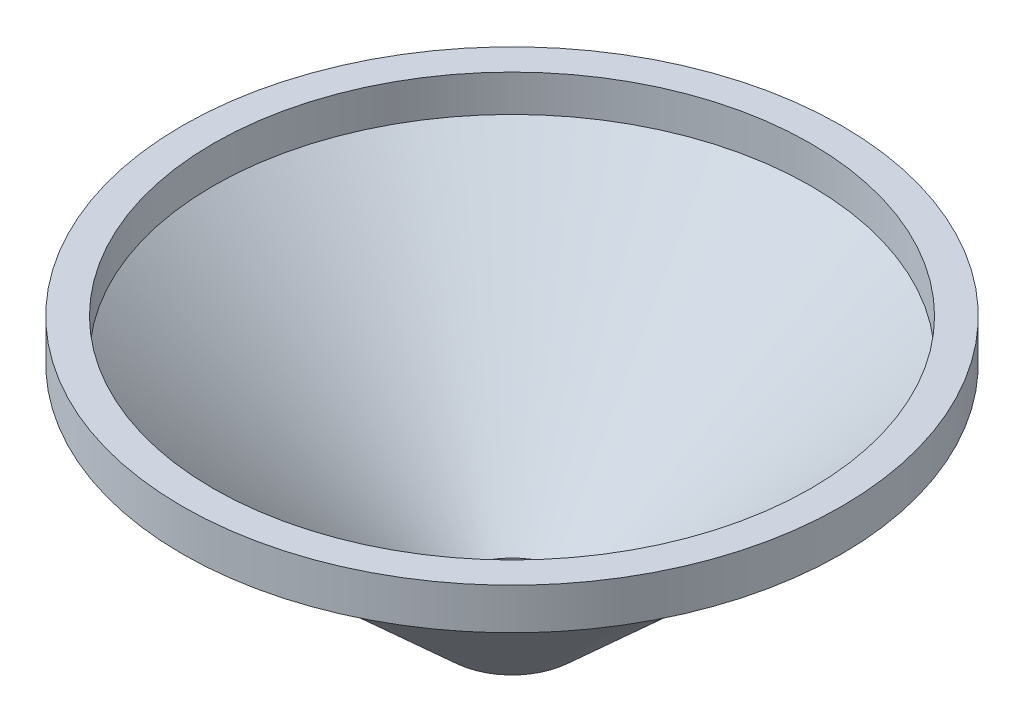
from build123d import *

# Parameters (mm, degrees)
SKETCH2_W          = 1
SKETCH2_H          = 2
SKETCH3_R          = 3
CUT_EXTRUDE1_DEPTH = 28.147743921


with BuildPart() as part:
    # Sketch1 → Revolve-Thin1 (revolve)
    with BuildSketch(Plane.XY, mode=Mode.PRIVATE) as revolve_thin1_sk:
        with BuildLine():
            Line((15, 0), (15, -2))
            Line((15, -2), (1.349281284, -14.47629266))
            ThreePointArc((1.349281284, -14.47629266), (0.723676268, -14.864481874), (0, -15))
            Line((0, -15), (0, -14.5))
            ThreePointArc((0, -14.5), (0.542757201, -14.398361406), (1.011960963, -14.107219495))
            Line((1.011960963, -14.107219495), (14.5, -1.779610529))
            Line((14.5, -1.779610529), (14.5, 0))
            Line((14.5, 0), (15, 0))
        make_face()
    revolve(revolve_thin1_sk.sketch.rotate(Axis((0, 0, 0), (0, -1, 0)), 90), axis=Axis((0, 0, 0), (0, -1, 0)))

    # Sketch2 → Revolve1 (revolve)
    with BuildSketch(Plane.XY, mode=Mode.PRIVATE) as revolve1_sk:
        with Locations((-15.5, -1)):
            Rectangle(SKETCH2_W, SKETCH2_H)
    revolve(revolve1_sk.sketch.rotate(Axis((0, 0, 0), (0, -1, 0)), 180), axis=Axis((0, 0, 0), (0, -1, 0)))

    # Sketch3 → Cut-Extrude1 (cut, through all)
    with BuildSketch(Plane(origin=(0, 0, 0), x_dir=(-1, 0, 0), z_dir=(0, 1, 0))):
        with Locations(Location((0, 0, 0), (0, 0, 90))):
            Circle(SKETCH3_R)
    extrude(amount=-CUT_EXTRUDE1_DEPTH, mode=Mode.SUBTRACT)


solid = part.part
